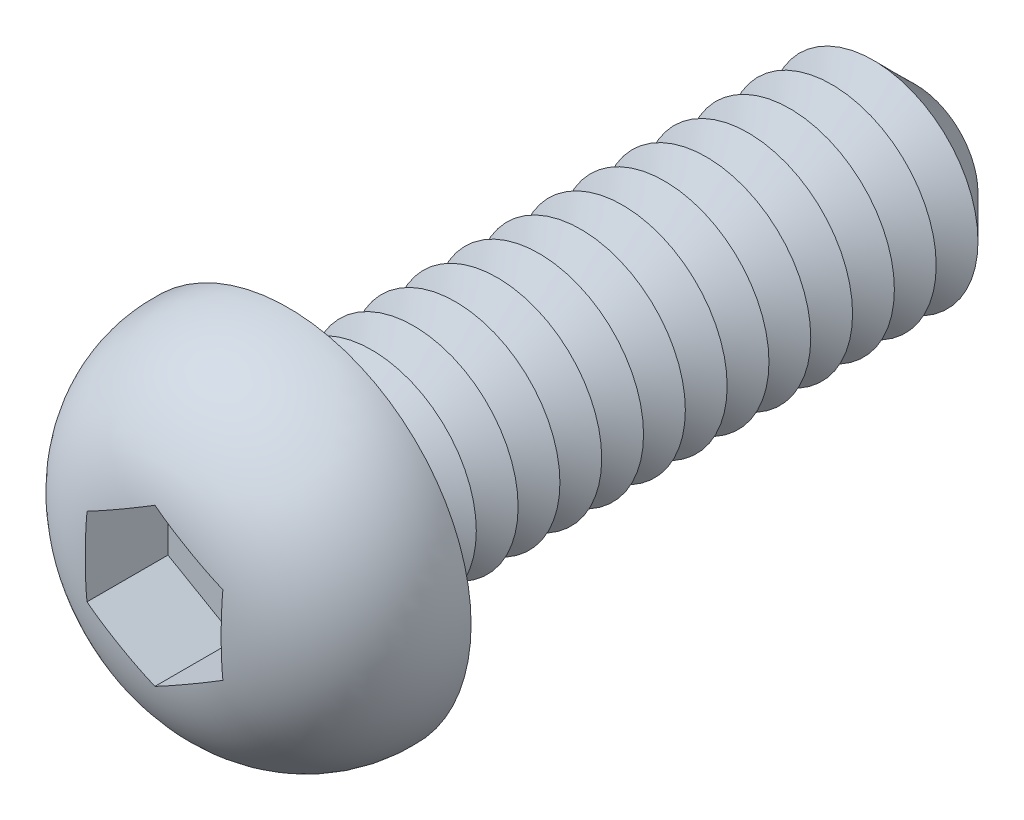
from build123d import *

# Parameters (mm, degrees)
CUT_EXTRUDE1_DEPTH  = 0.8
SKETCH4_R           = 1
BOSS_EXTRUDE1_DEPTH = 6
CHAMFER1_SIZE       = 0.4
LPATTERN1_COUNT     = 13
LPATTERN1_PITCH     = 0.4
FILLET2_R           = 0.2
SKETCH6_R           = 0.35
CUT_EXTRUDE2_DEPTH  = 6.5


with BuildPart() as part:
    # Sketch2 → Revolve1 (revolve)
    with BuildSketch(Plane(origin=(0, 0, 0), x_dir=(0, 0, -1), z_dir=(1, 0, 0)), mode=Mode.PRIVATE) as revolve1_sk:
        with BuildLine():
            Line((0, 0), (-1.3, 0))
            Line((-1.3, 0), (-1.3, 0.5010004))
            ThreePointArc((-1.3, 0.5010004), (-0.916025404, 1.402388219), (0, 1.75))
            Line((0, 1.75), (0, 0))
        make_face()
    revolve(revolve1_sk.sketch.rotate(Axis((0, 0, 47.934239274), (0, 0, -1)), 90), axis=Axis((0, 0, 47.934239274), (0, 0, -1)))

    # Sketch3 → Cut-Extrude1 (cut)
    with BuildSketch(Plane.XY.offset(1.3)):
        Polygon((0, 0.75055535), (-0.65, 0.375277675), (-0.65, -0.375277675), (0, -0.75055535), (0.65, -0.375277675), (0.65, 0.375277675), align=None)
    extrude(amount=-CUT_EXTRUDE1_DEPTH, mode=Mode.SUBTRACT)

    # Sketch4 → Boss-Extrude1 (add)
    with BuildSketch(Plane(origin=(0, 0, 0), x_dir=(-1, 0, 0), z_dir=(0, 0, -1))):
        Circle(SKETCH4_R)
    extrude(amount=BOSS_EXTRUDE1_DEPTH)

    # Chamfer1
    chamfer1_edges = [part.edges().sort_by_distance(p)[0] for p in [
        (1, 0, -6),
    ]]
    chamfer(chamfer1_edges, length=CHAMFER1_SIZE)

    # Sketch5 → Cut-Revolve1 (revolve, cut)
    with BuildSketch(Plane(origin=(0, 0, 0), x_dir=(0, 0, -1), z_dir=(1, 0, 0)), mode=Mode.PRIVATE) as cut_revolve1_sk:
        Polygon((0.4, 1), (0.8, 1), (0.6, 0.653589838), align=None)
    cut_revolve1 = revolve(cut_revolve1_sk.sketch.rotate(Axis((0, 0, 47.934239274), (0, 0, -1)), 90), axis=Axis((0, 0, 47.934239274), (0, 0, -1)), mode=Mode.SUBTRACT)

    # LPattern1: Cut-Revolve1 ×13
    with Locations(*[(0, 0, -i * LPATTERN1_PITCH) for i in range(1, LPATTERN1_COUNT)]):
        add(cut_revolve1, mode=Mode.SUBTRACT)

    # Fillet2
    fillet2_edges = [part.edges().sort_by_distance(p)[0] for p in [
        (1, 0, 0),
    ]]
    fillet(fillet2_edges, radius=FILLET2_R)

    # Sketch6 → Cut-Extrude2 (cut)
    with BuildSketch(Plane.XY.offset(0.5)):
        Circle(SKETCH6_R)
    extrude(amount=-CUT_EXTRUDE2_DEPTH, mode=Mode.SUBTRACT)


solid = part.part
